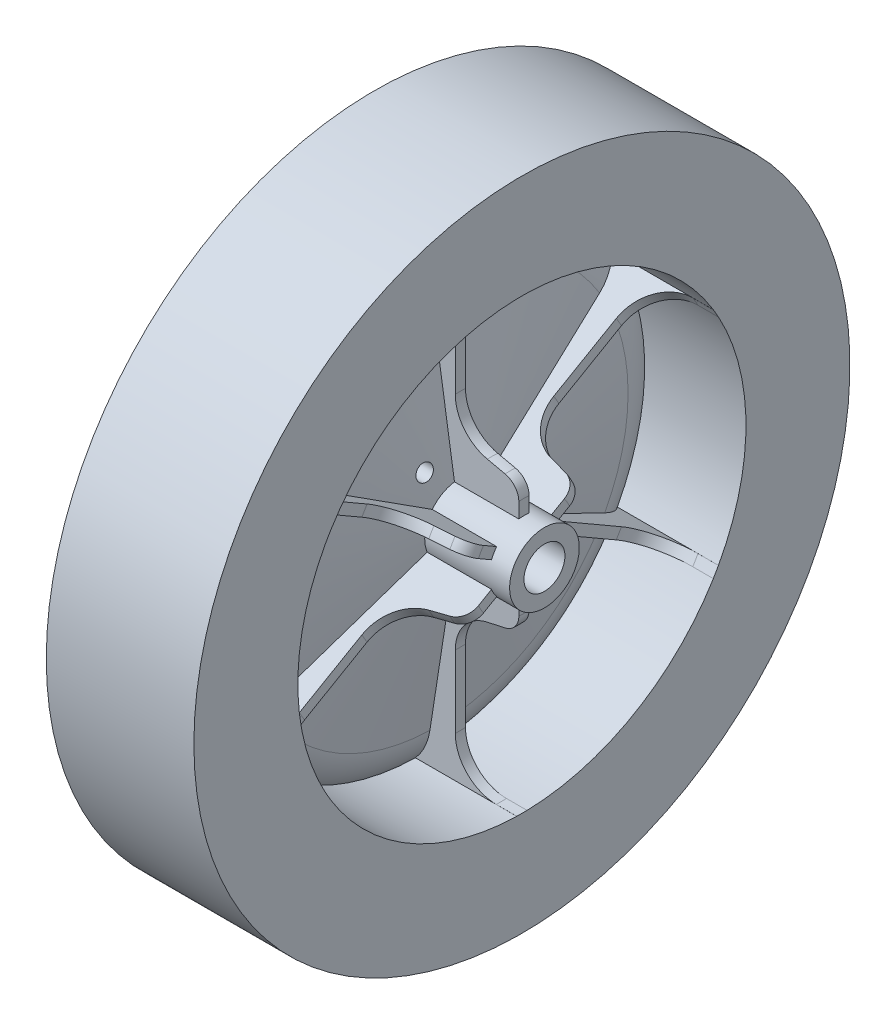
from build123d import *

# Parameters (mm, degrees)
BOSS_EXTRUDE1_REACH            = 161.396
BOSS_EXTRUDE1_START            = -6.35
BOSS_EXTRUDE2_REACH            = 161.396
BOSS_EXTRUDE2_END_MAJOR_RADIUS = 56.871948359
BOSS_EXTRUDE2_END_MINOR_RADIUS = 19.044295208
BOSS_EXTRUDE2_START            = -6.35
BOSS_EXTRUDE3_REACH            = 163.174
BOSS_EXTRUDE3_START            = -8.128
SKETCH5_R                      = 33.02
BOSS_EXTRUDE5_REACH            = 152.44
F_9_0_196_DIAMETER_HOLE1_D     = 4.9784


with BuildPart() as part:
    # Sketch1 → Revolve1 (revolve)
    with BuildSketch(Plane.XY, mode=Mode.PRIVATE) as revolve1_sk:
        with BuildLine():
            Line((-26.3525, 71.12), (-26.3525, 101.6))
            Line((-26.3525, 101.6), (19.3675, 101.6))
            Line((19.3675, 101.6), (19.3675, 69.4055))
            Line((19.3675, 69.4055), (-12.013906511, 69.4055))
            ThreePointArc((-12.013906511, 69.4055), (-9.090440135, 64.915981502), (-7.533070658, 59.789868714))
            Line((-7.533070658, 59.789868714), (0.0635, 10.795))
            Line((0.0635, 10.795), (26.3525, 10.795))
            Line((26.3525, 10.795), (26.3525, 6.35))
            Line((26.3525, 6.35), (-9.4615, 6.35))
            Line((-9.4615, 6.35), (-9.4615, 12.2555))
            Line((-9.4615, 12.2555), (-5.0165, 12.2555))
            Line((-5.0165, 12.2555), (-12.27268249, 59.055))
            ThreePointArc((-12.27268249, 59.055), (-17.081503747, 67.691172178), (-26.3525, 71.12))
        make_face()
    revolve(revolve1_sk.sketch.rotate(Axis((-26.3525, 0, 0), (1, 0, 0)), 90), axis=Axis((-26.3525, 0, 0), (1, 0, 0)))

    # Boss-Extrude1: up to this cone (the profile starts outside it)
    boss_extrude1_end = Plane(origin=(20.0025, 0, 0), z_dir=(-1, 0, 0)).offset(18.2652547) * Cone(6.45e-06, 926.361364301, 143.6307453, align=(Align.CENTER, Align.CENTER, Align.MIN), mode=Mode.PRIVATE)
    # Sketch2 → Boss-Extrude1 (add, up to the surface)
    with BuildSketch(Plane(origin=(26.3525, 0, 0), x_dir=(0, 0, -1), z_dir=(1, 0, 0)).offset(BOSS_EXTRUDE1_START), mode=Mode.PRIVATE) as boss_extrude1_sk1:
        with BuildLine():
            Line((-1.5875, 59.768789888), (-1.5875, 10.677634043))
            ThreePointArc((-1.5875, 10.677634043), (0, 10.795), (1.5875, 10.677634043))
            Line((1.5875, 10.677634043), (1.5875, 59.768789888))
            ThreePointArc((1.5875, 59.768789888), (0, 59.789868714), (-1.5875, 59.768789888))
        make_face()
    boss_extrude1_tool1 = extrude(boss_extrude1_sk1.sketch, amount=-BOSS_EXTRUDE1_REACH, mode=Mode.PRIVATE) - boss_extrude1_end
    add(boss_extrude1_tool1.solids().sort_by_distance((20.0025, 35.269391, 0))[0])
    # Sketch2 → Boss-Extrude1 (add, up to the surface)
    with BuildSketch(Plane(origin=(26.3525, 0, 0), x_dir=(0, 0, -1), z_dir=(1, 0, 0)).offset(BOSS_EXTRUDE1_START), mode=Mode.PRIVATE) as boss_extrude1_sk2:
        with BuildLine():
            Line((50.967540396, 31.259210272), (8.453352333, 6.71363235))
            ThreePointArc((8.453352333, 6.71363235), (9.348744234, 5.3975), (10.040852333, 3.964001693))
            Line((10.040852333, 3.964001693), (52.555040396, 28.509579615))
            ThreePointArc((52.555040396, 28.509579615), (51.779545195, 29.894934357), (50.967540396, 31.259210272))
        make_face()
    boss_extrude1_tool2 = extrude(boss_extrude1_sk2.sketch, amount=-BOSS_EXTRUDE1_REACH, mode=Mode.PRIVATE) - boss_extrude1_end
    add(boss_extrude1_tool2.solids().sort_by_distance((20.0025, 17.634696, -30.544189))[0])
    # Sketch2 → Boss-Extrude1 (add, up to the surface)
    with BuildSketch(Plane(origin=(26.3525, 0, 0), x_dir=(0, 0, -1), z_dir=(1, 0, 0)).offset(BOSS_EXTRUDE1_START), mode=Mode.PRIVATE) as boss_extrude1_sk3:
        with BuildLine():
            Line((52.555040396, -28.509579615), (10.040852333, -3.964001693))
            ThreePointArc((10.040852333, -3.964001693), (9.348744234, -5.3975), (8.453352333, -6.71363235))
            Line((8.453352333, -6.71363235), (50.967540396, -31.259210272))
            ThreePointArc((50.967540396, -31.259210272), (51.779545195, -29.894934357), (52.555040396, -28.509579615))
        make_face()
    boss_extrude1_tool3 = extrude(boss_extrude1_sk3.sketch, amount=-BOSS_EXTRUDE1_REACH, mode=Mode.PRIVATE) - boss_extrude1_end
    add(boss_extrude1_tool3.solids().sort_by_distance((20.0025, -17.634696, -30.544189))[0])
    # Sketch2 → Boss-Extrude1 (add, up to the surface)
    with BuildSketch(Plane(origin=(26.3525, 0, 0), x_dir=(0, 0, -1), z_dir=(1, 0, 0)).offset(BOSS_EXTRUDE1_START), mode=Mode.PRIVATE) as boss_extrude1_sk4:
        with BuildLine():
            Line((1.5875, -59.768789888), (1.5875, -10.677634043))
            ThreePointArc((1.5875, -10.677634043), (0, -10.795), (-1.5875, -10.677634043))
            Line((-1.5875, -10.677634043), (-1.5875, -59.768789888))
            ThreePointArc((-1.5875, -59.768789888), (0, -59.789868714), (1.5875, -59.768789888))
        make_face()
    boss_extrude1_tool4 = extrude(boss_extrude1_sk4.sketch, amount=-BOSS_EXTRUDE1_REACH, mode=Mode.PRIVATE) - boss_extrude1_end
    add(boss_extrude1_tool4.solids().sort_by_distance((20.0025, -35.269391, 0))[0])
    # Sketch2 → Boss-Extrude1 (add, up to the surface)
    with BuildSketch(Plane(origin=(26.3525, 0, 0), x_dir=(0, 0, -1), z_dir=(1, 0, 0)).offset(BOSS_EXTRUDE1_START), mode=Mode.PRIVATE) as boss_extrude1_sk5:
        with BuildLine():
            Line((-50.967540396, -31.259210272), (-8.453352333, -6.71363235))
            ThreePointArc((-8.453352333, -6.71363235), (-9.348744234, -5.3975), (-10.040852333, -3.964001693))
            Line((-10.040852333, -3.964001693), (-52.555040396, -28.509579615))
            ThreePointArc((-52.555040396, -28.509579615), (-51.779545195, -29.894934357), (-50.967540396, -31.259210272))
        make_face()
    boss_extrude1_tool5 = extrude(boss_extrude1_sk5.sketch, amount=-BOSS_EXTRUDE1_REACH, mode=Mode.PRIVATE) - boss_extrude1_end
    add(boss_extrude1_tool5.solids().sort_by_distance((20.0025, -17.634696, 30.544189))[0])
    # Sketch2 → Boss-Extrude1 (add, up to the surface)
    with BuildSketch(Plane(origin=(26.3525, 0, 0), x_dir=(0, 0, -1), z_dir=(1, 0, 0)).offset(BOSS_EXTRUDE1_START), mode=Mode.PRIVATE) as boss_extrude1_sk6:
        with BuildLine():
            Line((-52.555040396, 28.509579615), (-10.040852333, 3.964001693))
            ThreePointArc((-10.040852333, 3.964001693), (-9.348744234, 5.3975), (-8.453352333, 6.71363235))
            Line((-8.453352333, 6.71363235), (-50.967540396, 31.259210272))
            ThreePointArc((-50.967540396, 31.259210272), (-51.779545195, 29.894934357), (-52.555040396, 28.509579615))
        make_face()
    boss_extrude1_tool6 = extrude(boss_extrude1_sk6.sketch, amount=-BOSS_EXTRUDE1_REACH, mode=Mode.PRIVATE) - boss_extrude1_end
    add(boss_extrude1_tool6.solids().sort_by_distance((20.0025, 17.634696, 30.544189))[0])

    # Boss-Extrude2: up to this torus (the profile starts outside it)
    boss_extrude2_end = Plane(origin=(-26.3525, 0, 0), z_dir=(-1, 0, 0)) * Torus(BOSS_EXTRUDE2_END_MAJOR_RADIUS, BOSS_EXTRUDE2_END_MINOR_RADIUS, mode=Mode.PRIVATE)
    # Sketch3 → Boss-Extrude2 (add, up to the surface)
    with BuildSketch(Plane(origin=(26.3525, 0, 0), x_dir=(0, 0, -1), z_dir=(1, 0, 0)).offset(BOSS_EXTRUDE2_START), mode=Mode.PRIVATE) as boss_extrude2_sk1:
        with BuildLine():
            Line((-1.5875, 59.768789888), (-1.5875, 69.387342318))
            ThreePointArc((-1.5875, 69.387342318), (0, 69.4055), (1.5875, 69.387342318))
            Line((1.5875, 69.387342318), (1.5875, 59.768789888))
            ThreePointArc((1.5875, 59.768789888), (0, 59.789868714), (-1.5875, 59.768789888))
        make_face()
    boss_extrude2_tool1 = extrude(boss_extrude2_sk1.sketch, amount=-BOSS_EXTRUDE2_REACH, mode=Mode.PRIVATE) - boss_extrude2_end
    add(boss_extrude2_tool1.solids().sort_by_distance((20.0025, 64.591145, 0))[0])
    # Sketch3 → Boss-Extrude2 (add, up to the surface)
    with BuildSketch(Plane(origin=(26.3525, 0, 0), x_dir=(0, 0, -1), z_dir=(1, 0, 0)).offset(BOSS_EXTRUDE2_START), mode=Mode.PRIVATE) as boss_extrude2_sk2:
        with BuildLine():
            Line((50.967540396, 31.259210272), (59.297451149, 36.068486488))
            ThreePointArc((59.297451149, 36.068486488), (60.106926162, 34.70275), (60.884951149, 33.318855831))
            Line((60.884951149, 33.318855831), (52.555040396, 28.509579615))
            ThreePointArc((52.555040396, 28.509579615), (51.779545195, 29.894934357), (50.967540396, 31.259210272))
        make_face()
    boss_extrude2_tool2 = extrude(boss_extrude2_sk2.sketch, amount=-BOSS_EXTRUDE2_REACH, mode=Mode.PRIVATE) - boss_extrude2_end
    add(boss_extrude2_tool2.solids().sort_by_distance((20.0025, 32.295572, -55.937572))[0])
    # Sketch3 → Boss-Extrude2 (add, up to the surface)
    with BuildSketch(Plane(origin=(26.3525, 0, 0), x_dir=(0, 0, -1), z_dir=(1, 0, 0)).offset(BOSS_EXTRUDE2_START), mode=Mode.PRIVATE) as boss_extrude2_sk3:
        with BuildLine():
            Line((52.555040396, -28.509579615), (60.884951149, -33.318855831))
            ThreePointArc((60.884951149, -33.318855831), (60.106926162, -34.70275), (59.297451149, -36.068486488))
            Line((59.297451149, -36.068486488), (50.967540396, -31.259210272))
            ThreePointArc((50.967540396, -31.259210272), (51.779545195, -29.894934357), (52.555040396, -28.509579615))
        make_face()
    boss_extrude2_tool3 = extrude(boss_extrude2_sk3.sketch, amount=-BOSS_EXTRUDE2_REACH, mode=Mode.PRIVATE) - boss_extrude2_end
    add(boss_extrude2_tool3.solids().sort_by_distance((20.0025, -32.295572, -55.937572))[0])
    # Sketch3 → Boss-Extrude2 (add, up to the surface)
    with BuildSketch(Plane(origin=(26.3525, 0, 0), x_dir=(0, 0, -1), z_dir=(1, 0, 0)).offset(BOSS_EXTRUDE2_START), mode=Mode.PRIVATE) as boss_extrude2_sk4:
        with BuildLine():
            Line((1.5875, -59.768789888), (1.5875, -69.387342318))
            ThreePointArc((1.5875, -69.387342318), (0, -69.4055), (-1.5875, -69.387342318))
            Line((-1.5875, -69.387342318), (-1.5875, -59.768789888))
            ThreePointArc((-1.5875, -59.768789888), (0, -59.789868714), (1.5875, -59.768789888))
        make_face()
    boss_extrude2_tool4 = extrude(boss_extrude2_sk4.sketch, amount=-BOSS_EXTRUDE2_REACH, mode=Mode.PRIVATE) - boss_extrude2_end
    add(boss_extrude2_tool4.solids().sort_by_distance((20.0025, -64.591145, 0))[0])
    # Sketch3 → Boss-Extrude2 (add, up to the surface)
    with BuildSketch(Plane(origin=(26.3525, 0, 0), x_dir=(0, 0, -1), z_dir=(1, 0, 0)).offset(BOSS_EXTRUDE2_START), mode=Mode.PRIVATE) as boss_extrude2_sk5:
        with BuildLine():
            Line((-50.967540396, -31.259210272), (-59.297451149, -36.068486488))
            ThreePointArc((-59.297451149, -36.068486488), (-60.106926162, -34.70275), (-60.884951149, -33.318855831))
            Line((-60.884951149, -33.318855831), (-52.555040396, -28.509579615))
            ThreePointArc((-52.555040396, -28.509579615), (-51.779545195, -29.894934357), (-50.967540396, -31.259210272))
        make_face()
    boss_extrude2_tool5 = extrude(boss_extrude2_sk5.sketch, amount=-BOSS_EXTRUDE2_REACH, mode=Mode.PRIVATE) - boss_extrude2_end
    add(boss_extrude2_tool5.solids().sort_by_distance((20.0025, -32.295572, 55.937572))[0])
    # Sketch3 → Boss-Extrude2 (add, up to the surface)
    with BuildSketch(Plane(origin=(26.3525, 0, 0), x_dir=(0, 0, -1), z_dir=(1, 0, 0)).offset(BOSS_EXTRUDE2_START), mode=Mode.PRIVATE) as boss_extrude2_sk6:
        with BuildLine():
            Line((-52.555040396, 28.509579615), (-60.884951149, 33.318855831))
            ThreePointArc((-60.884951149, 33.318855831), (-60.106926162, 34.70275), (-59.297451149, 36.068486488))
            Line((-59.297451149, 36.068486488), (-50.967540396, 31.259210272))
            ThreePointArc((-50.967540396, 31.259210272), (-51.779545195, 29.894934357), (-52.555040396, 28.509579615))
        make_face()
    boss_extrude2_tool6 = extrude(boss_extrude2_sk6.sketch, amount=-BOSS_EXTRUDE2_REACH, mode=Mode.PRIVATE) - boss_extrude2_end
    add(boss_extrude2_tool6.solids().sort_by_distance((20.0025, 32.295572, 55.937572))[0])

    # Sketch4 → Cut-Revolve1 (revolve, cut)
    with BuildSketch(Plane.XY):
        with BuildLine():
            Line((15.767849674, 20.710882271), (10.28138312, 21.921324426))
            ThreePointArc((10.28138312, 21.921324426), (3.117028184, 26.368799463), (0.3175, 34.323084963))
            Line((0.3175, 34.323084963), (0.3175, 56.687342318))
            ThreePointArc((0.3175, 56.687342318), (4.037243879, 65.667598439), (13.0175, 69.387342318))
            Line((13.0175, 69.387342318), (19.3675, 69.387342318))
            Line((19.3675, 69.387342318), (19.3675, 69.965310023))
            Line((19.3675, 69.965310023), (20.0025, 69.965310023))
            Line((20.0025, 69.965310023), (20.0025, 69.387342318))
            Line((20.0025, 69.387342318), (20.0025, 15.440134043))
            ThreePointArc((20.0025, 15.440134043), (18.812700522, 18.82070538), (15.767849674, 20.710882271))
        make_face()
    revolve(axis=Axis((0, 0, 0), (1, 0, 0)), mode=Mode.SUBTRACT)

    # Boss-Extrude3: up to this cone (the profile starts inside it)
    boss_extrude3_end = Plane(origin=(-18.2245, 0, 0), z_dir=(-1, 0, 0)).offset(-15.108193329) * Cone(6.45e-06, 1781.535647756, 276.224056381, align=(Align.CENTER, Align.CENTER, Align.MIN), mode=Mode.PRIVATE)
    # Sketch5 → Boss-Extrude3 (add, up to the surface)
    with BuildSketch(Plane.ZY.offset(26.3525).offset(BOSS_EXTRUDE3_START), mode=Mode.PRIVATE) as boss_extrude3_sk1:
        with BuildLine():
            Line((-0.9525, 59.047318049), (-0.9525, 34.912008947))
            ThreePointArc((-0.9525, 34.912008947), (-9.03925515, 33.734959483), (-16.631115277, 30.710936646))
            Line((-16.631115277, 30.710936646), (-28.698769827, 51.612727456))
            ThreePointArc((-28.698769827, 51.612727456), (-29.5275, 51.14313022), (-30.348548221, 50.660227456))
            Line((-30.348548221, 50.660227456), (-18.280893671, 29.758436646))
            ThreePointArc((-18.280893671, 29.758436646), (-24.695704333, 24.695704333), (-29.758436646, 18.280893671))
            Line((-29.758436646, 18.280893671), (-50.660227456, 30.348548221))
            ThreePointArc((-50.660227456, 30.348548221), (-51.14313022, 29.5275), (-51.612727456, 28.698769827))
            Line((-51.612727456, 28.698769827), (-30.710936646, 16.631115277))
            ThreePointArc((-30.710936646, 16.631115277), (-33.734959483, 9.03925515), (-34.912008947, 0.9525))
            Line((-34.912008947, 0.9525), (-59.047318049, 0.9525))
            ThreePointArc((-59.047318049, 0.9525), (-59.055, 0), (-59.047318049, -0.9525))
            Line((-59.047318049, -0.9525), (-34.912008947, -0.9525))
            ThreePointArc((-34.912008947, -0.9525), (-33.734959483, -9.03925515), (-30.710936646, -16.631115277))
            Line((-30.710936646, -16.631115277), (-51.612727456, -28.698769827))
            ThreePointArc((-51.612727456, -28.698769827), (-51.14313022, -29.5275), (-50.660227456, -30.348548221))
            Line((-50.660227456, -30.348548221), (-29.758436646, -18.280893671))
            ThreePointArc((-29.758436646, -18.280893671), (-24.695704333, -24.695704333), (-18.280893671, -29.758436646))
            Line((-18.280893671, -29.758436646), (-30.348548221, -50.660227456))
            ThreePointArc((-30.348548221, -50.660227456), (-29.5275, -51.14313022), (-28.698769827, -51.612727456))
            Line((-28.698769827, -51.612727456), (-16.631115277, -30.710936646))
            ThreePointArc((-16.631115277, -30.710936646), (-9.03925515, -33.734959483), (-0.9525, -34.912008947))
            Line((-0.9525, -34.912008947), (-0.9525, -59.047318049))
            ThreePointArc((-0.9525, -59.047318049), (0, -59.055), (0.9525, -59.047318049))
            Line((0.9525, -59.047318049), (0.9525, -34.912008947))
            ThreePointArc((0.9525, -34.912008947), (9.03925515, -33.734959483), (16.631115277, -30.710936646))
            Line((16.631115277, -30.710936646), (28.698769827, -51.612727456))
            ThreePointArc((28.698769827, -51.612727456), (29.5275, -51.14313022), (30.348548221, -50.660227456))
            Line((30.348548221, -50.660227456), (18.280893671, -29.758436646))
            ThreePointArc((18.280893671, -29.758436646), (24.695704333, -24.695704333), (29.758436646, -18.280893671))
            Line((29.758436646, -18.280893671), (50.660227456, -30.348548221))
            ThreePointArc((50.660227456, -30.348548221), (51.14313022, -29.5275), (51.612727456, -28.698769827))
            Line((51.612727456, -28.698769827), (30.710936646, -16.631115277))
            ThreePointArc((30.710936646, -16.631115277), (33.734959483, -9.03925515), (34.912008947, -0.9525))
            Line((34.912008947, -0.9525), (59.047318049, -0.9525))
            ThreePointArc((59.047318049, -0.9525), (59.055, 0), (59.047318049, 0.9525))
            Line((59.047318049, 0.9525), (34.912008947, 0.9525))
            ThreePointArc((34.912008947, 0.9525), (33.734959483, 9.03925515), (30.710936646, 16.631115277))
            Line((30.710936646, 16.631115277), (51.612727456, 28.698769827))
            ThreePointArc((51.612727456, 28.698769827), (51.14313022, 29.5275), (50.660227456, 30.348548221))
            Line((50.660227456, 30.348548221), (29.758436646, 18.280893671))
            ThreePointArc((29.758436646, 18.280893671), (24.695704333, 24.695704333), (18.280893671, 29.758436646))
            Line((18.280893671, 29.758436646), (30.348548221, 50.660227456))
            ThreePointArc((30.348548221, 50.660227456), (29.5275, 51.14313022), (28.698769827, 51.612727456))
            Line((28.698769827, 51.612727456), (16.631115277, 30.710936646))
            ThreePointArc((16.631115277, 30.710936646), (9.03925515, 33.734959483), (0.9525, 34.912008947))
            Line((0.9525, 34.912008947), (0.9525, 59.047318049))
            ThreePointArc((0.9525, 59.047318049), (0, 59.055), (-0.9525, 59.047318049))
        make_face()
        Circle(SKETCH5_R, mode=Mode.SUBTRACT)
    boss_extrude3_tool1 = extrude(boss_extrude3_sk1.sketch, amount=-BOSS_EXTRUDE3_REACH, mode=Mode.PRIVATE) & boss_extrude3_end
    add(boss_extrude3_tool1.solids().sort_by_distance((-18.2245, 8.606943, 32.121547))[0])

    # Sketch6 → Boss-Extrude5 (add, up to next)
    with BuildSketch(Plane.ZY.offset(18.2245), mode=Mode.PRIVATE) as boss_extrude5_sk1:
        with BuildLine():
            Line((-0.9525, 59.047318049), (-0.9525, 71.113621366))
            ThreePointArc((-0.9525, 71.113621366), (0, 71.12), (0.9525, 71.113621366))
            Line((0.9525, 71.113621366), (0.9525, 59.047318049))
            ThreePointArc((0.9525, 59.047318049), (0, 59.055), (-0.9525, 59.047318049))
        make_face()
    boss_extrude5_tool1 = extrude(boss_extrude5_sk1.sketch, amount=-BOSS_EXTRUDE5_REACH, mode=Mode.PRIVATE) - part.part
    # Sketch6 → Boss-Extrude5 (add, up to next)
    with BuildSketch(Plane.ZY.offset(18.2245), mode=Mode.PRIVATE) as boss_extrude5_sk2:
        with BuildLine():
            Line((28.698769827, 51.612727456), (34.731921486, 62.062452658))
            ThreePointArc((34.731921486, 62.062452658), (35.56, 61.591726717), (36.38169988, 61.109952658))
            Line((36.38169988, 61.109952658), (30.348548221, 50.660227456))
            ThreePointArc((30.348548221, 50.660227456), (29.5275, 51.14313022), (28.698769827, 51.612727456))
        make_face()
    boss_extrude5_tool2 = extrude(boss_extrude5_sk2.sketch, amount=-BOSS_EXTRUDE5_REACH, mode=Mode.PRIVATE) - part.part
    # Sketch6 → Boss-Extrude5 (add, up to next)
    with BuildSketch(Plane.ZY.offset(18.2245), mode=Mode.PRIVATE) as boss_extrude5_sk3:
        with BuildLine():
            Line((50.660227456, 30.348548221), (61.109952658, 36.38169988))
            ThreePointArc((61.109952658, 36.38169988), (61.591726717, 35.56), (62.062452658, 34.731921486))
            Line((62.062452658, 34.731921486), (51.612727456, 28.698769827))
            ThreePointArc((51.612727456, 28.698769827), (51.14313022, 29.5275), (50.660227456, 30.348548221))
        make_face()
    boss_extrude5_tool3 = extrude(boss_extrude5_sk3.sketch, amount=-BOSS_EXTRUDE5_REACH, mode=Mode.PRIVATE) - part.part
    # Sketch6 → Boss-Extrude5 (add, up to next)
    with BuildSketch(Plane.ZY.offset(18.2245), mode=Mode.PRIVATE) as boss_extrude5_sk4:
        with BuildLine():
            Line((59.047318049, 0.9525), (71.113621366, 0.9525))
            ThreePointArc((71.113621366, 0.9525), (71.12, 0), (71.113621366, -0.9525))
            Line((71.113621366, -0.9525), (59.047318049, -0.9525))
            ThreePointArc((59.047318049, -0.9525), (59.055, 0), (59.047318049, 0.9525))
        make_face()
    boss_extrude5_tool4 = extrude(boss_extrude5_sk4.sketch, amount=-BOSS_EXTRUDE5_REACH, mode=Mode.PRIVATE) - part.part
    # Sketch6 → Boss-Extrude5 (add, up to next)
    with BuildSketch(Plane.ZY.offset(18.2245), mode=Mode.PRIVATE) as boss_extrude5_sk5:
        with BuildLine():
            Line((51.612727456, -28.698769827), (62.062452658, -34.731921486))
            ThreePointArc((62.062452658, -34.731921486), (61.591726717, -35.56), (61.109952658, -36.38169988))
            Line((61.109952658, -36.38169988), (50.660227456, -30.348548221))
            ThreePointArc((50.660227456, -30.348548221), (51.14313022, -29.5275), (51.612727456, -28.698769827))
        make_face()
    boss_extrude5_tool5 = extrude(boss_extrude5_sk5.sketch, amount=-BOSS_EXTRUDE5_REACH, mode=Mode.PRIVATE) - part.part
    # Sketch6 → Boss-Extrude5 (add, up to next)
    with BuildSketch(Plane.ZY.offset(18.2245), mode=Mode.PRIVATE) as boss_extrude5_sk6:
        with BuildLine():
            Line((30.348548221, -50.660227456), (36.38169988, -61.109952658))
            ThreePointArc((36.38169988, -61.109952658), (35.56, -61.591726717), (34.731921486, -62.062452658))
            Line((34.731921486, -62.062452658), (28.698769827, -51.612727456))
            ThreePointArc((28.698769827, -51.612727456), (29.5275, -51.14313022), (30.348548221, -50.660227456))
        make_face()
    boss_extrude5_tool6 = extrude(boss_extrude5_sk6.sketch, amount=-BOSS_EXTRUDE5_REACH, mode=Mode.PRIVATE) - part.part
    # Sketch6 → Boss-Extrude5 (add, up to next)
    with BuildSketch(Plane.ZY.offset(18.2245), mode=Mode.PRIVATE) as boss_extrude5_sk7:
        with BuildLine():
            Line((0.9525, -59.047318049), (0.9525, -71.113621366))
            ThreePointArc((0.9525, -71.113621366), (0, -71.12), (-0.9525, -71.113621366))
            Line((-0.9525, -71.113621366), (-0.9525, -59.047318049))
            ThreePointArc((-0.9525, -59.047318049), (0, -59.055), (0.9525, -59.047318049))
        make_face()
    boss_extrude5_tool7 = extrude(boss_extrude5_sk7.sketch, amount=-BOSS_EXTRUDE5_REACH, mode=Mode.PRIVATE) - part.part
    # Sketch6 → Boss-Extrude5 (add, up to next)
    with BuildSketch(Plane.ZY.offset(18.2245), mode=Mode.PRIVATE) as boss_extrude5_sk8:
        with BuildLine():
            Line((-28.698769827, -51.612727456), (-34.731921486, -62.062452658))
            ThreePointArc((-34.731921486, -62.062452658), (-35.56, -61.591726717), (-36.38169988, -61.109952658))
            Line((-36.38169988, -61.109952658), (-30.348548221, -50.660227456))
            ThreePointArc((-30.348548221, -50.660227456), (-29.5275, -51.14313022), (-28.698769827, -51.612727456))
        make_face()
    boss_extrude5_tool8 = extrude(boss_extrude5_sk8.sketch, amount=-BOSS_EXTRUDE5_REACH, mode=Mode.PRIVATE) - part.part
    # Sketch6 → Boss-Extrude5 (add, up to next)
    with BuildSketch(Plane.ZY.offset(18.2245), mode=Mode.PRIVATE) as boss_extrude5_sk9:
        with BuildLine():
            Line((-50.660227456, -30.348548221), (-61.109952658, -36.38169988))
            ThreePointArc((-61.109952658, -36.38169988), (-61.591726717, -35.56), (-62.062452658, -34.731921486))
            Line((-62.062452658, -34.731921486), (-51.612727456, -28.698769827))
            ThreePointArc((-51.612727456, -28.698769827), (-51.14313022, -29.5275), (-50.660227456, -30.348548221))
        make_face()
    boss_extrude5_tool9 = extrude(boss_extrude5_sk9.sketch, amount=-BOSS_EXTRUDE5_REACH, mode=Mode.PRIVATE) - part.part
    # Sketch6 → Boss-Extrude5 (add, up to next)
    with BuildSketch(Plane.ZY.offset(18.2245), mode=Mode.PRIVATE) as boss_extrude5_sk10:
        with BuildLine():
            Line((-59.047318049, -0.9525), (-71.113621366, -0.9525))
            ThreePointArc((-71.113621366, -0.9525), (-71.12, 0), (-71.113621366, 0.9525))
            Line((-71.113621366, 0.9525), (-59.047318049, 0.9525))
            ThreePointArc((-59.047318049, 0.9525), (-59.055, 0), (-59.047318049, -0.9525))
        make_face()
    boss_extrude5_tool10 = extrude(boss_extrude5_sk10.sketch, amount=-BOSS_EXTRUDE5_REACH, mode=Mode.PRIVATE) - part.part
    # Sketch6 → Boss-Extrude5 (add, up to next)
    with BuildSketch(Plane.ZY.offset(18.2245), mode=Mode.PRIVATE) as boss_extrude5_sk11:
        with BuildLine():
            Line((-51.612727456, 28.698769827), (-62.062452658, 34.731921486))
            ThreePointArc((-62.062452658, 34.731921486), (-61.591726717, 35.56), (-61.109952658, 36.38169988))
            Line((-61.109952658, 36.38169988), (-50.660227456, 30.348548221))
            ThreePointArc((-50.660227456, 30.348548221), (-51.14313022, 29.5275), (-51.612727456, 28.698769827))
        make_face()
    boss_extrude5_tool11 = extrude(boss_extrude5_sk11.sketch, amount=-BOSS_EXTRUDE5_REACH, mode=Mode.PRIVATE) - part.part
    # Sketch6 → Boss-Extrude5 (add, up to next)
    with BuildSketch(Plane.ZY.offset(18.2245), mode=Mode.PRIVATE) as boss_extrude5_sk12:
        with BuildLine():
            Line((-30.348548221, 50.660227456), (-36.38169988, 61.109952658))
            ThreePointArc((-36.38169988, 61.109952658), (-35.56, 61.591726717), (-34.731921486, 62.062452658))
            Line((-34.731921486, 62.062452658), (-28.698769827, 51.612727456))
            ThreePointArc((-28.698769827, 51.612727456), (-29.5275, 51.14313022), (-30.348548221, 50.660227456))
        make_face()
    boss_extrude5_tool12 = extrude(boss_extrude5_sk12.sketch, amount=-BOSS_EXTRUDE5_REACH, mode=Mode.PRIVATE) - part.part
    add(boss_extrude5_tool1.solids().sort_by_distance((-18.2245, 65.085157, 0))[0])
    add(boss_extrude5_tool2.solids().sort_by_distance((-18.2245, 56.365399, 32.542578))[0])
    add(boss_extrude5_tool3.solids().sort_by_distance((-18.2245, 32.542578, 56.365399))[0])
    add(boss_extrude5_tool4.solids().sort_by_distance((-18.2245, 0, 65.085157))[0])
    add(boss_extrude5_tool5.solids().sort_by_distance((-18.2245, -32.542578, 56.365399))[0])
    add(boss_extrude5_tool6.solids().sort_by_distance((-18.2245, -56.365399, 32.542578))[0])
    add(boss_extrude5_tool7.solids().sort_by_distance((-18.2245, -65.085157, 0))[0])
    add(boss_extrude5_tool8.solids().sort_by_distance((-18.2245, -56.365399, -32.542578))[0])
    add(boss_extrude5_tool9.solids().sort_by_distance((-18.2245, -32.542578, -56.365399))[0])
    add(boss_extrude5_tool10.solids().sort_by_distance((-18.2245, 0, -65.085157))[0])
    add(boss_extrude5_tool11.solids().sort_by_distance((-18.2245, 32.542578, -56.365399))[0])
    add(boss_extrude5_tool12.solids().sort_by_distance((-18.2245, 56.365399, -32.542578))[0])

    # 9 _0.196_ Diameter Hole1 (through all)
    with Locations(Plane(origin=(26.3525, 0, 0), x_dir=(0, 0, -1), z_dir=(1, 0, 0))):
        with Locations((19.05, 0), (-9.525, 16.497783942), (-9.525, -16.497783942)):
            Hole(F_9_0_196_DIAMETER_HOLE1_D / 2)


solid = part.part
